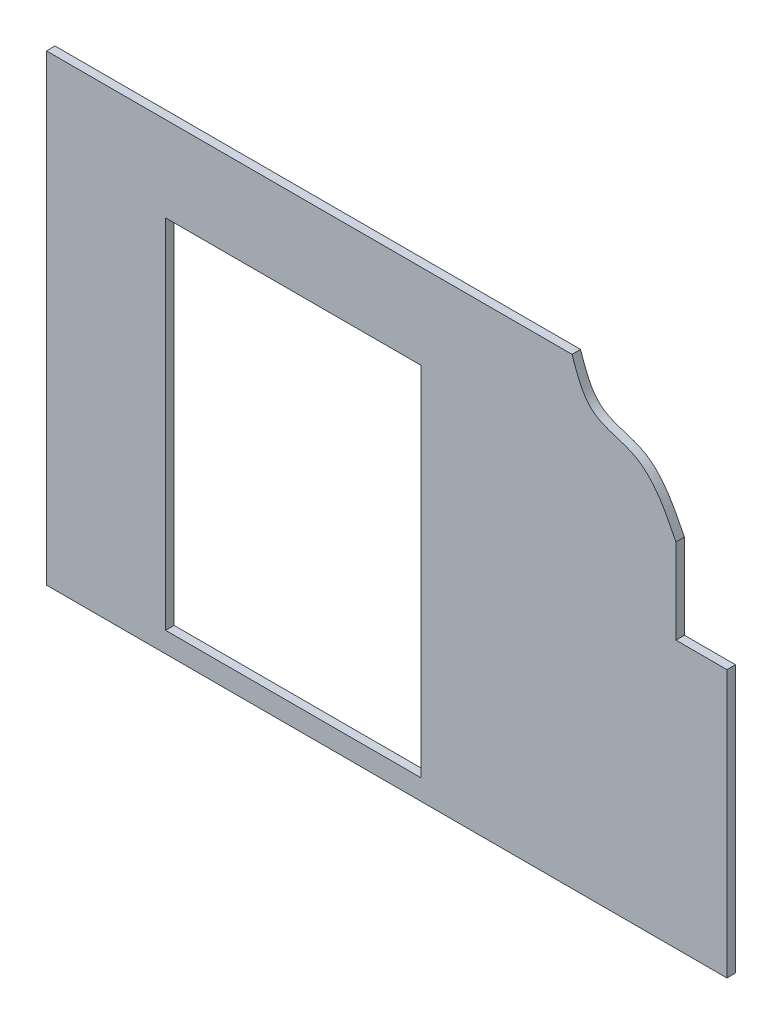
ISO-10303-21;
HEADER;
FILE_DESCRIPTION(('STEP AP214'),'2;1');
FILE_NAME('part.step','',(''),(''),'','','');
FILE_SCHEMA(('AUTOMOTIVE_DESIGN { 1 0 10303 214 1 1 1 1 }'));
ENDSEC;
DATA;
#1=APPLICATION_CONTEXT('core data for automotive mechanical design processes');
#2=APPLICATION_PROTOCOL_DEFINITION('international standard','automotive_design',2000,#1);
#3=PRODUCT_CONTEXT('',#1,'mechanical');
#4=PRODUCT('Part','Part','',(#3));
#5=PRODUCT_RELATED_PRODUCT_CATEGORY('part','',(#4));
#6=PRODUCT_DEFINITION_FORMATION('','',#4);
#7=PRODUCT_DEFINITION_CONTEXT('part definition',#1,'design');
#8=PRODUCT_DEFINITION('design','',#6,#7);
#9=PRODUCT_DEFINITION_SHAPE('','',#8);
#10=(LENGTH_UNIT() NAMED_UNIT(*) SI_UNIT(.MILLI.,.METRE.));
#11=(NAMED_UNIT(*) PLANE_ANGLE_UNIT() SI_UNIT($,.RADIAN.));
#12=(NAMED_UNIT(*) SI_UNIT($,.STERADIAN.) SOLID_ANGLE_UNIT());
#13=UNCERTAINTY_MEASURE_WITH_UNIT(LENGTH_MEASURE(1.E-05),#10,'distance_accuracy_value','');
#14=(GEOMETRIC_REPRESENTATION_CONTEXT(3) GLOBAL_UNCERTAINTY_ASSIGNED_CONTEXT((#13)) GLOBAL_UNIT_ASSIGNED_CONTEXT((#10,
#11,#12)) REPRESENTATION_CONTEXT('',''));
#15=CARTESIAN_POINT('',(0.,0.,0.));
#16=DIRECTION('',(0.,0.,1.));
#17=DIRECTION('',(1.,0.,0.));
#18=AXIS2_PLACEMENT_3D('',#15,#16,#17);
#19=CARTESIAN_POINT('',(341.489416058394,-240.38644790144,5.));
#20=DIRECTION('',(1.,0.,0.));
#21=DIRECTION('',(0.,0.,-1.));
#22=AXIS2_PLACEMENT_3D('',#19,#20,#21);
#23=PLANE('',#22);
#24=DIRECTION('',(0.,-1.,0.));
#25=VECTOR('',#24,1.);
#26=CARTESIAN_POINT('',(341.489416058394,-240.38644790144,0.));
#27=LINE('',#26,#25);
#28=CARTESIAN_POINT('',(341.489416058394,207.,0.));
#29=VERTEX_POINT('',#28);
#30=CARTESIAN_POINT('',(341.489416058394,157.,0.));
#31=VERTEX_POINT('',#30);
#32=EDGE_CURVE('E139',#29,#31,#27,.T.);
#33=ORIENTED_EDGE('',*,*,#32,.F.);
#34=DIRECTION('',(0.,0.,-1.));
#35=VECTOR('',#34,1.);
#36=CARTESIAN_POINT('',(341.489416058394,207.,5.));
#37=LINE('',#36,#35);
#38=CARTESIAN_POINT('',(341.489416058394,207.,5.));
#39=VERTEX_POINT('',#38);
#40=EDGE_CURVE('E11',#39,#29,#37,.T.);
#41=ORIENTED_EDGE('',*,*,#40,.F.);
#42=DIRECTION('',(0.,-1.,0.));
#43=VECTOR('',#42,1.);
#44=CARTESIAN_POINT('',(341.489416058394,-240.38644790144,5.));
#45=LINE('',#44,#43);
#46=CARTESIAN_POINT('',(341.489416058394,157.,5.));
#47=VERTEX_POINT('',#46);
#48=EDGE_CURVE('E172',#39,#47,#45,.T.);
#49=ORIENTED_EDGE('',*,*,#48,.T.);
#50=DIRECTION('',(0.,0.,-1.));
#51=VECTOR('',#50,1.);
#52=CARTESIAN_POINT('',(341.489416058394,157.,5.));
#53=LINE('',#52,#51);
#54=EDGE_CURVE('E43',#47,#31,#53,.T.);
#55=ORIENTED_EDGE('',*,*,#54,.T.);
#56=EDGE_LOOP('',(#33,#41,#49,#55));
#57=FACE_BOUND('',#56,.T.);
#58=ADVANCED_FACE('F26',(#57),#23,.T.);
#59=CARTESIAN_POINT('',(341.489416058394,207.,5.));
#60=CARTESIAN_POINT('',(335.0212332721,220.004625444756,5.));
#61=CARTESIAN_POINT('',(324.565439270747,241.026555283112,5.));
#62=CARTESIAN_POINT('',(289.634908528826,245.053974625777,5.));
#63=CARTESIAN_POINT('',(283.552303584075,262.815377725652,5.));
#64=CARTESIAN_POINT('',(280.406919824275,272.,5.));
#65=B_SPLINE_CURVE_WITH_KNOTS('',3,(#59,#60,#61,#62,#63,#64),.UNSPECIFIED.,.F.,.F.,(4,1,1,4),
(0.,0.439235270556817,0.710022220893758,1.),.UNSPECIFIED.);
#66=DIRECTION('',(0.,0.,-1.));
#67=VECTOR('',#66,1.);
#68=SURFACE_OF_LINEAR_EXTRUSION('',#65,#67);
#69=CARTESIAN_POINT('',(341.489416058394,207.,0.));
#70=CARTESIAN_POINT('',(335.0212332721,220.004625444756,0.));
#71=CARTESIAN_POINT('',(324.565439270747,241.026555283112,0.));
#72=CARTESIAN_POINT('',(289.634908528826,245.053974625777,0.));
#73=CARTESIAN_POINT('',(283.552303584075,262.815377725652,0.));
#74=CARTESIAN_POINT('',(280.406919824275,272.,0.));
#75=B_SPLINE_CURVE_WITH_KNOTS('',3,(#69,#70,#71,#72,#73,#74),.UNSPECIFIED.,.F.,.F.,(4,1,1,4),
(0.,0.439235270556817,0.710022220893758,1.),.UNSPECIFIED.);
#76=CARTESIAN_POINT('',(280.406919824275,272.,0.));
#77=VERTEX_POINT('',#76);
#78=EDGE_CURVE('E142',#29,#77,#75,.T.);
#79=ORIENTED_EDGE('',*,*,#78,.T.);
#80=DIRECTION('',(0.,0.,-1.));
#81=VECTOR('',#80,1.);
#82=CARTESIAN_POINT('',(280.406919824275,272.,5.));
#83=LINE('',#82,#81);
#84=CARTESIAN_POINT('',(280.406919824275,272.,5.));
#85=VERTEX_POINT('',#84);
#86=EDGE_CURVE('E35',#85,#77,#83,.T.);
#87=ORIENTED_EDGE('',*,*,#86,.F.);
#88=EDGE_CURVE('E174',#39,#85,#65,.T.);
#89=ORIENTED_EDGE('',*,*,#88,.F.);
#90=ORIENTED_EDGE('',*,*,#40,.T.);
#91=EDGE_LOOP('',(#79,#87,#89,#90));
#92=FACE_BOUND('',#91,.T.);
#93=ADVANCED_FACE('F185',(#92),#68,.F.);
#94=CARTESIAN_POINT('',(171.489416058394,272.,5.));
#95=DIRECTION('',(0.,1.,0.));
#96=DIRECTION('',(0.,0.,1.));
#97=AXIS2_PLACEMENT_3D('',#94,#95,#96);
#98=PLANE('',#97);
#99=DIRECTION('',(1.,0.,0.));
#100=VECTOR('',#99,1.);
#101=CARTESIAN_POINT('',(171.489416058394,272.,0.));
#102=LINE('',#101,#100);
#103=CARTESIAN_POINT('',(-28.5105839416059,272.,0.));
#104=VERTEX_POINT('',#103);
#105=EDGE_CURVE('E147',#104,#77,#102,.T.);
#106=ORIENTED_EDGE('',*,*,#105,.F.);
#107=DIRECTION('',(0.,0.,-1.));
#108=VECTOR('',#107,1.);
#109=CARTESIAN_POINT('',(-28.5105839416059,272.,5.));
#110=LINE('',#109,#108);
#111=CARTESIAN_POINT('',(-28.5105839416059,272.,5.));
#112=VERTEX_POINT('',#111);
#113=EDGE_CURVE('E231',#112,#104,#110,.T.);
#114=ORIENTED_EDGE('',*,*,#113,.F.);
#115=DIRECTION('',(1.,0.,0.));
#116=VECTOR('',#115,1.);
#117=CARTESIAN_POINT('',(171.489416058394,272.,5.));
#118=LINE('',#117,#116);
#119=EDGE_CURVE('E179',#112,#85,#118,.T.);
#120=ORIENTED_EDGE('',*,*,#119,.T.);
#121=ORIENTED_EDGE('',*,*,#86,.T.);
#122=EDGE_LOOP('',(#106,#114,#120,#121));
#123=FACE_BOUND('',#122,.T.);
#124=ADVANCED_FACE('F189',(#123),#98,.T.);
#125=CARTESIAN_POINT('',(-28.5105839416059,-240.38644790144,5.));
#126=DIRECTION('',(-1.,0.,0.));
#127=DIRECTION('',(0.,0.,1.));
#128=AXIS2_PLACEMENT_3D('',#125,#126,#127);
#129=PLANE('',#128);
#130=DIRECTION('',(0.,1.,0.));
#131=VECTOR('',#130,1.);
#132=CARTESIAN_POINT('',(-28.5105839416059,-240.38644790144,0.));
#133=LINE('',#132,#131);
#134=CARTESIAN_POINT('',(-28.5105839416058,0.,0.));
#135=VERTEX_POINT('',#134);
#136=EDGE_CURVE('E153',#135,#104,#133,.T.);
#137=ORIENTED_EDGE('',*,*,#136,.F.);
#138=DIRECTION('',(0.,0.,-1.));
#139=VECTOR('',#138,1.);
#140=CARTESIAN_POINT('',(-28.5105839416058,0.,5.));
#141=LINE('',#140,#139);
#142=CARTESIAN_POINT('',(-28.5105839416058,0.,5.));
#143=VERTEX_POINT('',#142);
#144=EDGE_CURVE('E229',#143,#135,#141,.T.);
#145=ORIENTED_EDGE('',*,*,#144,.F.);
#146=DIRECTION('',(0.,1.,0.));
#147=VECTOR('',#146,1.);
#148=CARTESIAN_POINT('',(-28.5105839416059,-240.38644790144,5.));
#149=LINE('',#148,#147);
#150=EDGE_CURVE('E263',#143,#112,#149,.T.);
#151=ORIENTED_EDGE('',*,*,#150,.T.);
#152=ORIENTED_EDGE('',*,*,#113,.T.);
#153=EDGE_LOOP('',(#137,#145,#151,#152));
#154=FACE_BOUND('',#153,.T.);
#155=ADVANCED_FACE('F216',(#154),#129,.T.);
#156=CARTESIAN_POINT('',(171.489416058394,0.,5.));
#157=DIRECTION('',(0.,1.,0.));
#158=DIRECTION('',(0.,0.,1.));
#159=AXIS2_PLACEMENT_3D('',#156,#157,#158);
#160=PLANE('',#159);
#161=DIRECTION('',(1.,0.,0.));
#162=VECTOR('',#161,1.);
#163=CARTESIAN_POINT('',(171.489416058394,0.,0.));
#164=LINE('',#163,#162);
#165=CARTESIAN_POINT('',(371.489416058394,0.,0.));
#166=VERTEX_POINT('',#165);
#167=EDGE_CURVE('E156',#135,#166,#164,.T.);
#168=ORIENTED_EDGE('',*,*,#167,.T.);
#169=DIRECTION('',(0.,0.,-1.));
#170=VECTOR('',#169,1.);
#171=CARTESIAN_POINT('',(371.489416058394,0.,5.));
#172=LINE('',#171,#170);
#173=CARTESIAN_POINT('',(371.489416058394,0.,5.));
#174=VERTEX_POINT('',#173);
#175=EDGE_CURVE('E236',#174,#166,#172,.T.);
#176=ORIENTED_EDGE('',*,*,#175,.F.);
#177=DIRECTION('',(1.,0.,0.));
#178=VECTOR('',#177,1.);
#179=CARTESIAN_POINT('',(171.489416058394,0.,5.));
#180=LINE('',#179,#178);
#181=EDGE_CURVE('E237',#143,#174,#180,.T.);
#182=ORIENTED_EDGE('',*,*,#181,.F.);
#183=ORIENTED_EDGE('',*,*,#144,.T.);
#184=EDGE_LOOP('',(#168,#176,#182,#183));
#185=FACE_BOUND('',#184,.T.);
#186=ADVANCED_FACE('F211',(#185),#160,.F.);
#187=CARTESIAN_POINT('',(371.489416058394,-240.38644790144,5.));
#188=DIRECTION('',(1.,0.,0.));
#189=DIRECTION('',(0.,1.,0.));
#190=AXIS2_PLACEMENT_3D('',#187,#188,#189);
#191=PLANE('',#190);
#192=DIRECTION('',(0.,-1.,0.));
#193=VECTOR('',#192,1.);
#194=CARTESIAN_POINT('',(371.489416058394,-240.38644790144,0.));
#195=LINE('',#194,#193);
#196=CARTESIAN_POINT('',(371.489416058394,157.,0.));
#197=VERTEX_POINT('',#196);
#198=EDGE_CURVE('E159',#197,#166,#195,.T.);
#199=ORIENTED_EDGE('',*,*,#198,.F.);
#200=DIRECTION('',(0.,0.,-1.));
#201=VECTOR('',#200,1.);
#202=CARTESIAN_POINT('',(371.489416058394,157.,5.));
#203=LINE('',#202,#201);
#204=CARTESIAN_POINT('',(371.489416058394,157.,5.));
#205=VERTEX_POINT('',#204);
#206=EDGE_CURVE('E51',#205,#197,#203,.T.);
#207=ORIENTED_EDGE('',*,*,#206,.F.);
#208=DIRECTION('',(0.,-1.,0.));
#209=VECTOR('',#208,1.);
#210=CARTESIAN_POINT('',(371.489416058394,-240.38644790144,5.));
#211=LINE('',#210,#209);
#212=EDGE_CURVE('E264',#205,#174,#211,.T.);
#213=ORIENTED_EDGE('',*,*,#212,.T.);
#214=ORIENTED_EDGE('',*,*,#175,.T.);
#215=EDGE_LOOP('',(#199,#207,#213,#214));
#216=FACE_BOUND('',#215,.T.);
#217=ADVANCED_FACE('F207',(#216),#191,.T.);
#218=CARTESIAN_POINT('',(191.489416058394,-240.38644790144,5.));
#219=DIRECTION('',(-1.,0.,0.));
#220=DIRECTION('',(0.,0.,1.));
#221=AXIS2_PLACEMENT_3D('',#218,#219,#220);
#222=PLANE('',#221);
#223=DIRECTION('',(0.,1.,0.));
#224=VECTOR('',#223,1.);
#225=CARTESIAN_POINT('',(191.489416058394,-240.38644790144,0.));
#226=LINE('',#225,#224);
#227=CARTESIAN_POINT('',(191.489416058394,12.,0.));
#228=VERTEX_POINT('',#227);
#229=CARTESIAN_POINT('',(191.489416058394,222.,0.));
#230=VERTEX_POINT('',#229);
#231=EDGE_CURVE('E123',#228,#230,#226,.T.);
#232=ORIENTED_EDGE('',*,*,#231,.F.);
#233=DIRECTION('',(0.,0.,-1.));
#234=VECTOR('',#233,1.);
#235=CARTESIAN_POINT('',(191.489416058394,12.,5.));
#236=LINE('',#235,#234);
#237=CARTESIAN_POINT('',(191.489416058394,12.,5.));
#238=VERTEX_POINT('',#237);
#239=EDGE_CURVE('E30',#238,#228,#236,.T.);
#240=ORIENTED_EDGE('',*,*,#239,.F.);
#241=DIRECTION('',(0.,1.,0.));
#242=VECTOR('',#241,1.);
#243=CARTESIAN_POINT('',(191.489416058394,-240.38644790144,5.));
#244=LINE('',#243,#242);
#245=CARTESIAN_POINT('',(191.489416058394,222.,5.));
#246=VERTEX_POINT('',#245);
#247=EDGE_CURVE('E165',#238,#246,#244,.T.);
#248=ORIENTED_EDGE('',*,*,#247,.T.);
#249=DIRECTION('',(0.,0.,-1.));
#250=VECTOR('',#249,1.);
#251=CARTESIAN_POINT('',(191.489416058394,222.,5.));
#252=LINE('',#251,#250);
#253=EDGE_CURVE('E125',#246,#230,#252,.T.);
#254=ORIENTED_EDGE('',*,*,#253,.T.);
#255=EDGE_LOOP('',(#232,#240,#248,#254));
#256=FACE_BOUND('',#255,.T.);
#257=ADVANCED_FACE('F28',(#256),#222,.T.);
#258=CARTESIAN_POINT('',(171.489416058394,12.,5.));
#259=DIRECTION('',(0.,1.,0.));
#260=DIRECTION('',(0.,0.,1.));
#261=AXIS2_PLACEMENT_3D('',#258,#259,#260);
#262=PLANE('',#261);
#263=DIRECTION('',(1.,0.,0.));
#264=VECTOR('',#263,1.);
#265=CARTESIAN_POINT('',(171.489416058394,12.,0.));
#266=LINE('',#265,#264);
#267=CARTESIAN_POINT('',(41.4894160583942,12.,0.));
#268=VERTEX_POINT('',#267);
#269=EDGE_CURVE('E115',#268,#228,#266,.T.);
#270=ORIENTED_EDGE('',*,*,#269,.F.);
#271=DIRECTION('',(0.,0.,-1.));
#272=VECTOR('',#271,1.);
#273=CARTESIAN_POINT('',(41.4894160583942,12.,5.));
#274=LINE('',#273,#272);
#275=CARTESIAN_POINT('',(41.4894160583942,12.,5.));
#276=VERTEX_POINT('',#275);
#277=EDGE_CURVE('E121',#276,#268,#274,.T.);
#278=ORIENTED_EDGE('',*,*,#277,.F.);
#279=DIRECTION('',(1.,0.,0.));
#280=VECTOR('',#279,1.);
#281=CARTESIAN_POINT('',(171.489416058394,12.,5.));
#282=LINE('',#281,#280);
#283=EDGE_CURVE('E117',#276,#238,#282,.T.);
#284=ORIENTED_EDGE('',*,*,#283,.T.);
#285=ORIENTED_EDGE('',*,*,#239,.T.);
#286=EDGE_LOOP('',(#270,#278,#284,#285));
#287=FACE_BOUND('',#286,.T.);
#288=ADVANCED_FACE('F113',(#287),#262,.T.);
#289=CARTESIAN_POINT('',(41.4894160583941,-240.38644790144,5.));
#290=DIRECTION('',(-1.,0.,0.));
#291=DIRECTION('',(0.,0.,1.));
#292=AXIS2_PLACEMENT_3D('',#289,#290,#291);
#293=PLANE('',#292);
#294=DIRECTION('',(0.,1.,0.));
#295=VECTOR('',#294,1.);
#296=CARTESIAN_POINT('',(41.4894160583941,-240.38644790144,0.));
#297=LINE('',#296,#295);
#298=CARTESIAN_POINT('',(41.4894160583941,222.,0.));
#299=VERTEX_POINT('',#298);
#300=EDGE_CURVE('E133',#268,#299,#297,.T.);
#301=ORIENTED_EDGE('',*,*,#300,.T.);
#302=DIRECTION('',(0.,0.,-1.));
#303=VECTOR('',#302,1.);
#304=CARTESIAN_POINT('',(41.4894160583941,222.,5.));
#305=LINE('',#304,#303);
#306=CARTESIAN_POINT('',(41.4894160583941,222.,5.));
#307=VERTEX_POINT('',#306);
#308=EDGE_CURVE('E246',#307,#299,#305,.T.);
#309=ORIENTED_EDGE('',*,*,#308,.F.);
#310=DIRECTION('',(0.,1.,0.));
#311=VECTOR('',#310,1.);
#312=CARTESIAN_POINT('',(41.4894160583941,-240.38644790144,5.));
#313=LINE('',#312,#311);
#314=EDGE_CURVE('E168',#276,#307,#313,.T.);
#315=ORIENTED_EDGE('',*,*,#314,.F.);
#316=ORIENTED_EDGE('',*,*,#277,.T.);
#317=EDGE_LOOP('',(#301,#309,#315,#316));
#318=FACE_BOUND('',#317,.T.);
#319=ADVANCED_FACE('F199',(#318),#293,.F.);
#320=CARTESIAN_POINT('',(171.489416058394,222.,5.));
#321=DIRECTION('',(0.,1.,0.));
#322=DIRECTION('',(0.,0.,1.));
#323=AXIS2_PLACEMENT_3D('',#320,#321,#322);
#324=PLANE('',#323);
#325=DIRECTION('',(1.,0.,0.));
#326=VECTOR('',#325,1.);
#327=CARTESIAN_POINT('',(171.489416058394,222.,0.));
#328=LINE('',#327,#326);
#329=EDGE_CURVE('E135',#299,#230,#328,.T.);
#330=ORIENTED_EDGE('',*,*,#329,.T.);
#331=ORIENTED_EDGE('',*,*,#253,.F.);
#332=DIRECTION('',(1.,0.,0.));
#333=VECTOR('',#332,1.);
#334=CARTESIAN_POINT('',(171.489416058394,222.,5.));
#335=LINE('',#334,#333);
#336=EDGE_CURVE('E170',#307,#246,#335,.T.);
#337=ORIENTED_EDGE('',*,*,#336,.F.);
#338=ORIENTED_EDGE('',*,*,#308,.T.);
#339=EDGE_LOOP('',(#330,#331,#337,#338));
#340=FACE_BOUND('',#339,.T.);
#341=ADVANCED_FACE('F195',(#340),#324,.F.);
#342=CARTESIAN_POINT('',(171.489416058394,157.,5.));
#343=DIRECTION('',(0.,1.,0.));
#344=DIRECTION('',(0.,0.,1.));
#345=AXIS2_PLACEMENT_3D('',#342,#343,#344);
#346=PLANE('',#345);
#347=DIRECTION('',(1.,0.,0.));
#348=VECTOR('',#347,1.);
#349=CARTESIAN_POINT('',(171.489416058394,157.,0.));
#350=LINE('',#349,#348);
#351=EDGE_CURVE('E162',#31,#197,#350,.T.);
#352=ORIENTED_EDGE('',*,*,#351,.F.);
#353=ORIENTED_EDGE('',*,*,#54,.F.);
#354=DIRECTION('',(1.,0.,0.));
#355=VECTOR('',#354,1.);
#356=CARTESIAN_POINT('',(171.489416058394,157.,5.));
#357=LINE('',#356,#355);
#358=EDGE_CURVE('E247',#47,#205,#357,.T.);
#359=ORIENTED_EDGE('',*,*,#358,.T.);
#360=ORIENTED_EDGE('',*,*,#206,.T.);
#361=EDGE_LOOP('',(#352,#353,#359,#360));
#362=FACE_BOUND('',#361,.T.);
#363=ADVANCED_FACE('F198',(#362),#346,.T.);
#364=CARTESIAN_POINT('',(171.489416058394,-240.38644790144,5.));
#365=DIRECTION('',(0.,0.,1.));
#366=DIRECTION('',(1.,0.,0.));
#367=AXIS2_PLACEMENT_3D('',#364,#365,#366);
#368=PLANE('',#367);
#369=ORIENTED_EDGE('',*,*,#247,.F.);
#370=ORIENTED_EDGE('',*,*,#283,.F.);
#371=ORIENTED_EDGE('',*,*,#314,.T.);
#372=ORIENTED_EDGE('',*,*,#336,.T.);
#373=EDGE_LOOP('',(#369,#370,#371,#372));
#374=FACE_BOUND('',#373,.T.);
#375=ORIENTED_EDGE('',*,*,#48,.F.);
#376=ORIENTED_EDGE('',*,*,#88,.T.);
#377=ORIENTED_EDGE('',*,*,#119,.F.);
#378=ORIENTED_EDGE('',*,*,#150,.F.);
#379=ORIENTED_EDGE('',*,*,#181,.T.);
#380=ORIENTED_EDGE('',*,*,#212,.F.);
#381=ORIENTED_EDGE('',*,*,#358,.F.);
#382=EDGE_LOOP('',(#375,#376,#377,#378,#379,#380,#381));
#383=FACE_BOUND('',#382,.T.);
#384=ADVANCED_FACE('F253',(#374,#383),#368,.T.);
#385=CARTESIAN_POINT('',(171.489416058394,-240.38644790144,0.));
#386=DIRECTION('',(0.,0.,1.));
#387=DIRECTION('',(1.,0.,0.));
#388=AXIS2_PLACEMENT_3D('',#385,#386,#387);
#389=PLANE('',#388);
#390=ORIENTED_EDGE('',*,*,#231,.T.);
#391=ORIENTED_EDGE('',*,*,#329,.F.);
#392=ORIENTED_EDGE('',*,*,#300,.F.);
#393=ORIENTED_EDGE('',*,*,#269,.T.);
#394=EDGE_LOOP('',(#390,#391,#392,#393));
#395=FACE_BOUND('',#394,.T.);
#396=ORIENTED_EDGE('',*,*,#32,.T.);
#397=ORIENTED_EDGE('',*,*,#351,.T.);
#398=ORIENTED_EDGE('',*,*,#198,.T.);
#399=ORIENTED_EDGE('',*,*,#167,.F.);
#400=ORIENTED_EDGE('',*,*,#136,.T.);
#401=ORIENTED_EDGE('',*,*,#105,.T.);
#402=ORIENTED_EDGE('',*,*,#78,.F.);
#403=EDGE_LOOP('',(#396,#397,#398,#399,#400,#401,#402));
#404=FACE_BOUND('',#403,.T.);
#405=ADVANCED_FACE('F131',(#395,#404),#389,.F.);
#406=CLOSED_SHELL('',(#58,#93,#124,#155,#186,#217,#257,#288,#319,#341,#363,#384,#405));
#407=MANIFOLD_SOLID_BREP('B2',#406);
#408=ADVANCED_BREP_SHAPE_REPRESENTATION('',(#18,#407),#14);
#409=SHAPE_DEFINITION_REPRESENTATION(#9,#408);
ENDSEC;
END-ISO-10303-21;
